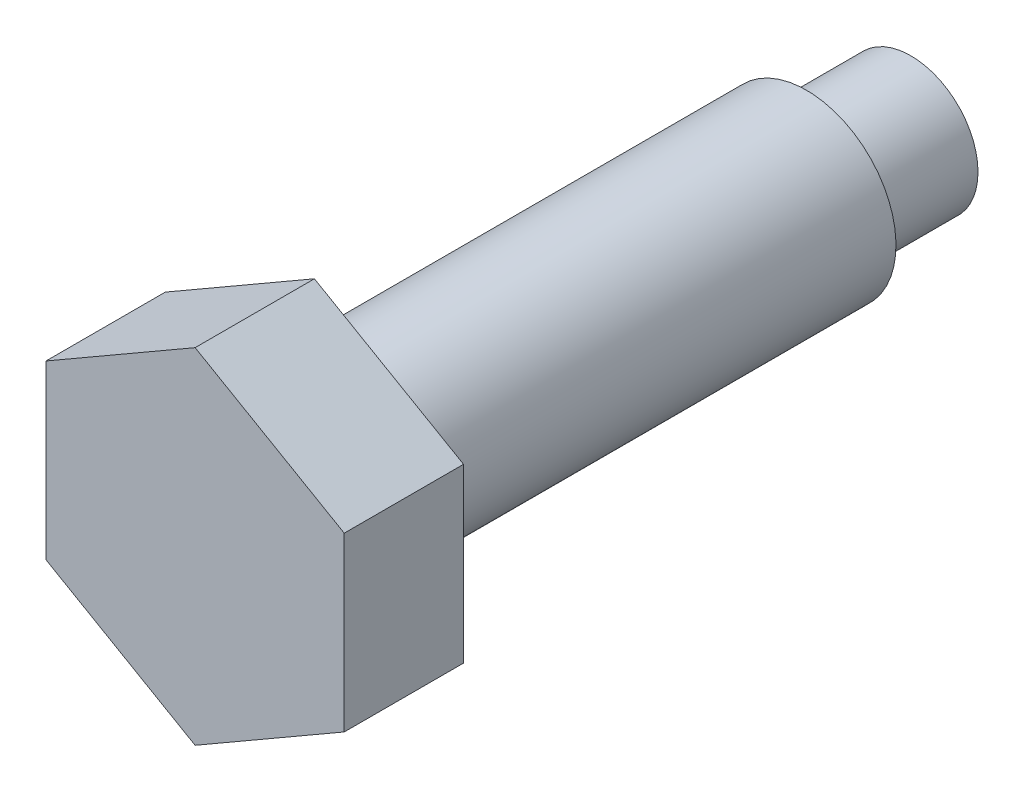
ISO-10303-21;
HEADER;
FILE_DESCRIPTION(('STEP AP214'),'2;1');
FILE_NAME('part.step','',(''),(''),'','','');
FILE_SCHEMA(('AUTOMOTIVE_DESIGN { 1 0 10303 214 1 1 1 1 }'));
ENDSEC;
DATA;
#1=APPLICATION_CONTEXT('core data for automotive mechanical design processes');
#2=APPLICATION_PROTOCOL_DEFINITION('international standard','automotive_design',2000,#1);
#3=PRODUCT_CONTEXT('',#1,'mechanical');
#4=PRODUCT('Part','Part','',(#3));
#5=PRODUCT_RELATED_PRODUCT_CATEGORY('part','',(#4));
#6=PRODUCT_DEFINITION_FORMATION('','',#4);
#7=PRODUCT_DEFINITION_CONTEXT('part definition',#1,'design');
#8=PRODUCT_DEFINITION('design','',#6,#7);
#9=PRODUCT_DEFINITION_SHAPE('','',#8);
#10=(LENGTH_UNIT() NAMED_UNIT(*) SI_UNIT(.MILLI.,.METRE.));
#11=(NAMED_UNIT(*) PLANE_ANGLE_UNIT() SI_UNIT($,.RADIAN.));
#12=(NAMED_UNIT(*) SI_UNIT($,.STERADIAN.) SOLID_ANGLE_UNIT());
#13=UNCERTAINTY_MEASURE_WITH_UNIT(LENGTH_MEASURE(1.E-05),#10,'distance_accuracy_value','');
#14=(GEOMETRIC_REPRESENTATION_CONTEXT(3) GLOBAL_UNCERTAINTY_ASSIGNED_CONTEXT((#13)) GLOBAL_UNIT_ASSIGNED_CONTEXT((#10,
#11,#12)) REPRESENTATION_CONTEXT('',''));
#15=CARTESIAN_POINT('',(0.,0.,0.));
#16=DIRECTION('',(0.,0.,1.));
#17=DIRECTION('',(1.,0.,0.));
#18=AXIS2_PLACEMENT_3D('',#15,#16,#17);
#19=CARTESIAN_POINT('',(-5.,8.66025403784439,0.));
#20=DIRECTION('',(0.,0.,1.));
#21=DIRECTION('',(0.,-1.,0.));
#22=AXIS2_PLACEMENT_3D('',#19,#20,#21);
#23=PLANE('',#22);
#24=DIRECTION('',(-0.866025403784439,0.5,0.));
#25=VECTOR('',#24,1.);
#26=CARTESIAN_POINT('',(5.,2.88675134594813,0.));
#27=LINE('',#26,#25);
#28=CARTESIAN_POINT('',(5.,2.88675134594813,0.));
#29=VERTEX_POINT('',#28);
#30=CARTESIAN_POINT('',(0.,5.77350269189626,0.));
#31=VERTEX_POINT('',#30);
#32=EDGE_CURVE('E72',#29,#31,#27,.T.);
#33=ORIENTED_EDGE('',*,*,#32,.F.);
#34=DIRECTION('',(0.,1.,0.));
#35=VECTOR('',#34,1.);
#36=CARTESIAN_POINT('',(5.,-2.88675134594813,0.));
#37=LINE('',#36,#35);
#38=CARTESIAN_POINT('',(5.,-2.88675134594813,0.));
#39=VERTEX_POINT('',#38);
#40=EDGE_CURVE('E99',#39,#29,#37,.T.);
#41=ORIENTED_EDGE('',*,*,#40,.F.);
#42=DIRECTION('',(0.866025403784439,0.5,0.));
#43=VECTOR('',#42,1.);
#44=CARTESIAN_POINT('',(0.,-5.77350269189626,0.));
#45=LINE('',#44,#43);
#46=CARTESIAN_POINT('',(0.,-5.77350269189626,0.));
#47=VERTEX_POINT('',#46);
#48=EDGE_CURVE('E97',#47,#39,#45,.T.);
#49=ORIENTED_EDGE('',*,*,#48,.F.);
#50=DIRECTION('',(0.866025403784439,-0.5,0.));
#51=VECTOR('',#50,1.);
#52=CARTESIAN_POINT('',(-5.,-2.88675134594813,0.));
#53=LINE('',#52,#51);
#54=CARTESIAN_POINT('',(-5.,-2.88675134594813,0.));
#55=VERTEX_POINT('',#54);
#56=EDGE_CURVE('E95',#55,#47,#53,.T.);
#57=ORIENTED_EDGE('',*,*,#56,.F.);
#58=DIRECTION('',(0.,-1.,0.));
#59=VECTOR('',#58,1.);
#60=CARTESIAN_POINT('',(-5.,2.88675134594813,0.));
#61=LINE('',#60,#59);
#62=CARTESIAN_POINT('',(-5.,2.88675134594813,0.));
#63=VERTEX_POINT('',#62);
#64=EDGE_CURVE('E74',#63,#55,#61,.T.);
#65=ORIENTED_EDGE('',*,*,#64,.F.);
#66=DIRECTION('',(-0.866025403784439,-0.5,0.));
#67=VECTOR('',#66,1.);
#68=CARTESIAN_POINT('',(0.,5.77350269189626,0.));
#69=LINE('',#68,#67);
#70=EDGE_CURVE('E67',#31,#63,#69,.T.);
#71=ORIENTED_EDGE('',*,*,#70,.F.);
#72=EDGE_LOOP('',(#33,#41,#49,#57,#65,#71));
#73=FACE_BOUND('',#72,.T.);
#74=CARTESIAN_POINT('',(0.,0.,0.));
#75=DIRECTION('',(0.,0.,1.));
#76=DIRECTION('',(0.,-1.,0.));
#77=AXIS2_PLACEMENT_3D('',#74,#75,#76);
#78=CIRCLE('',#77,3.);
#79=CARTESIAN_POINT('',(0.,-3.,0.));
#80=VERTEX_POINT('',#79);
#81=EDGE_CURVE('E9',#80,#80,#78,.F.);
#82=ORIENTED_EDGE('',*,*,#81,.F.);
#83=EDGE_LOOP('',(#82));
#84=FACE_BOUND('',#83,.T.);
#85=ADVANCED_FACE('F14',(#73,#84),#23,.F.);
#86=CARTESIAN_POINT('',(5.,2.88675134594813,4.));
#87=DIRECTION('',(-0.5,-0.866025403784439,0.));
#88=DIRECTION('',(0.866025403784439,-0.5,0.));
#89=AXIS2_PLACEMENT_3D('',#86,#87,#88);
#90=PLANE('',#89);
#91=ORIENTED_EDGE('',*,*,#32,.T.);
#92=DIRECTION('',(0.,0.,-1.));
#93=VECTOR('',#92,1.);
#94=CARTESIAN_POINT('',(0.,5.77350269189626,4.));
#95=LINE('',#94,#93);
#96=CARTESIAN_POINT('',(0.,5.77350269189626,4.));
#97=VERTEX_POINT('',#96);
#98=EDGE_CURVE('E22',#97,#31,#95,.T.);
#99=ORIENTED_EDGE('',*,*,#98,.F.);
#100=DIRECTION('',(-0.866025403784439,0.5,0.));
#101=VECTOR('',#100,1.);
#102=CARTESIAN_POINT('',(5.,2.88675134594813,4.));
#103=LINE('',#102,#101);
#104=CARTESIAN_POINT('',(5.,2.88675134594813,4.));
#105=VERTEX_POINT('',#104);
#106=EDGE_CURVE('E101',#105,#97,#103,.T.);
#107=ORIENTED_EDGE('',*,*,#106,.F.);
#108=DIRECTION('',(0.,0.,-1.));
#109=VECTOR('',#108,1.);
#110=CARTESIAN_POINT('',(5.,2.88675134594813,4.));
#111=LINE('',#110,#109);
#112=EDGE_CURVE('E86',#105,#29,#111,.T.);
#113=ORIENTED_EDGE('',*,*,#112,.T.);
#114=EDGE_LOOP('',(#91,#99,#107,#113));
#115=FACE_BOUND('',#114,.T.);
#116=ADVANCED_FACE('F16',(#115),#90,.F.);
#117=CARTESIAN_POINT('',(0.,5.77350269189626,4.));
#118=DIRECTION('',(0.5,-0.866025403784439,0.));
#119=DIRECTION('',(0.866025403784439,0.5,0.));
#120=AXIS2_PLACEMENT_3D('',#117,#118,#119);
#121=PLANE('',#120);
#122=ORIENTED_EDGE('',*,*,#70,.T.);
#123=DIRECTION('',(0.,0.,-1.));
#124=VECTOR('',#123,1.);
#125=CARTESIAN_POINT('',(-5.,2.88675134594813,4.));
#126=LINE('',#125,#124);
#127=CARTESIAN_POINT('',(-5.,2.88675134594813,4.));
#128=VERTEX_POINT('',#127);
#129=EDGE_CURVE('E84',#128,#63,#126,.T.);
#130=ORIENTED_EDGE('',*,*,#129,.F.);
#131=DIRECTION('',(-0.866025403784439,-0.5,0.));
#132=VECTOR('',#131,1.);
#133=CARTESIAN_POINT('',(0.,5.77350269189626,4.));
#134=LINE('',#133,#132);
#135=EDGE_CURVE('E81',#97,#128,#134,.T.);
#136=ORIENTED_EDGE('',*,*,#135,.F.);
#137=ORIENTED_EDGE('',*,*,#98,.T.);
#138=EDGE_LOOP('',(#122,#130,#136,#137));
#139=FACE_BOUND('',#138,.T.);
#140=ADVANCED_FACE('F80',(#139),#121,.F.);
#141=CARTESIAN_POINT('',(-5.,2.88675134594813,4.));
#142=DIRECTION('',(1.,0.,0.));
#143=DIRECTION('',(0.,1.,0.));
#144=AXIS2_PLACEMENT_3D('',#141,#142,#143);
#145=PLANE('',#144);
#146=ORIENTED_EDGE('',*,*,#64,.T.);
#147=DIRECTION('',(0.,0.,-1.));
#148=VECTOR('',#147,1.);
#149=CARTESIAN_POINT('',(-5.,-2.88675134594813,4.));
#150=LINE('',#149,#148);
#151=CARTESIAN_POINT('',(-5.,-2.88675134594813,4.));
#152=VERTEX_POINT('',#151);
#153=EDGE_CURVE('E117',#152,#55,#150,.T.);
#154=ORIENTED_EDGE('',*,*,#153,.F.);
#155=DIRECTION('',(0.,-1.,0.));
#156=VECTOR('',#155,1.);
#157=CARTESIAN_POINT('',(-5.,2.88675134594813,4.));
#158=LINE('',#157,#156);
#159=EDGE_CURVE('E104',#128,#152,#158,.T.);
#160=ORIENTED_EDGE('',*,*,#159,.F.);
#161=ORIENTED_EDGE('',*,*,#129,.T.);
#162=EDGE_LOOP('',(#146,#154,#160,#161));
#163=FACE_BOUND('',#162,.T.);
#164=ADVANCED_FACE('F122',(#163),#145,.F.);
#165=CARTESIAN_POINT('',(-5.,-2.88675134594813,4.));
#166=DIRECTION('',(0.5,0.866025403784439,0.));
#167=DIRECTION('',(-0.866025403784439,0.5,0.));
#168=AXIS2_PLACEMENT_3D('',#165,#166,#167);
#169=PLANE('',#168);
#170=ORIENTED_EDGE('',*,*,#56,.T.);
#171=DIRECTION('',(0.,0.,-1.));
#172=VECTOR('',#171,1.);
#173=CARTESIAN_POINT('',(0.,-5.77350269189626,4.));
#174=LINE('',#173,#172);
#175=CARTESIAN_POINT('',(0.,-5.77350269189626,4.));
#176=VERTEX_POINT('',#175);
#177=EDGE_CURVE('E114',#176,#47,#174,.T.);
#178=ORIENTED_EDGE('',*,*,#177,.F.);
#179=DIRECTION('',(0.866025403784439,-0.5,0.));
#180=VECTOR('',#179,1.);
#181=CARTESIAN_POINT('',(-5.,-2.88675134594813,4.));
#182=LINE('',#181,#180);
#183=EDGE_CURVE('E106',#152,#176,#182,.T.);
#184=ORIENTED_EDGE('',*,*,#183,.F.);
#185=ORIENTED_EDGE('',*,*,#153,.T.);
#186=EDGE_LOOP('',(#170,#178,#184,#185));
#187=FACE_BOUND('',#186,.T.);
#188=ADVANCED_FACE('F128',(#187),#169,.F.);
#189=CARTESIAN_POINT('',(0.,-5.77350269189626,4.));
#190=DIRECTION('',(-0.5,0.866025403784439,0.));
#191=DIRECTION('',(-0.866025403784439,-0.5,0.));
#192=AXIS2_PLACEMENT_3D('',#189,#190,#191);
#193=PLANE('',#192);
#194=ORIENTED_EDGE('',*,*,#48,.T.);
#195=DIRECTION('',(0.,0.,-1.));
#196=VECTOR('',#195,1.);
#197=CARTESIAN_POINT('',(5.,-2.88675134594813,4.));
#198=LINE('',#197,#196);
#199=CARTESIAN_POINT('',(5.,-2.88675134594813,4.));
#200=VERTEX_POINT('',#199);
#201=EDGE_CURVE('E111',#200,#39,#198,.T.);
#202=ORIENTED_EDGE('',*,*,#201,.F.);
#203=DIRECTION('',(0.866025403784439,0.5,0.));
#204=VECTOR('',#203,1.);
#205=CARTESIAN_POINT('',(0.,-5.77350269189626,4.));
#206=LINE('',#205,#204);
#207=EDGE_CURVE('E34',#176,#200,#206,.T.);
#208=ORIENTED_EDGE('',*,*,#207,.F.);
#209=ORIENTED_EDGE('',*,*,#177,.T.);
#210=EDGE_LOOP('',(#194,#202,#208,#209));
#211=FACE_BOUND('',#210,.T.);
#212=ADVANCED_FACE('F131',(#211),#193,.F.);
#213=CARTESIAN_POINT('',(5.,-2.88675134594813,4.));
#214=DIRECTION('',(-1.,0.,0.));
#215=DIRECTION('',(0.,-1.,0.));
#216=AXIS2_PLACEMENT_3D('',#213,#214,#215);
#217=PLANE('',#216);
#218=ORIENTED_EDGE('',*,*,#40,.T.);
#219=ORIENTED_EDGE('',*,*,#112,.F.);
#220=DIRECTION('',(0.,1.,0.));
#221=VECTOR('',#220,1.);
#222=CARTESIAN_POINT('',(5.,-2.88675134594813,4.));
#223=LINE('',#222,#221);
#224=EDGE_CURVE('E29',#200,#105,#223,.T.);
#225=ORIENTED_EDGE('',*,*,#224,.F.);
#226=ORIENTED_EDGE('',*,*,#201,.T.);
#227=EDGE_LOOP('',(#218,#219,#225,#226));
#228=FACE_BOUND('',#227,.T.);
#229=ADVANCED_FACE('F133',(#228),#217,.F.);
#230=CARTESIAN_POINT('',(-5.,8.66025403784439,4.));
#231=DIRECTION('',(0.,0.,1.));
#232=DIRECTION('',(0.,-1.,0.));
#233=AXIS2_PLACEMENT_3D('',#230,#231,#232);
#234=PLANE('',#233);
#235=ORIENTED_EDGE('',*,*,#106,.T.);
#236=ORIENTED_EDGE('',*,*,#135,.T.);
#237=ORIENTED_EDGE('',*,*,#159,.T.);
#238=ORIENTED_EDGE('',*,*,#183,.T.);
#239=ORIENTED_EDGE('',*,*,#207,.T.);
#240=ORIENTED_EDGE('',*,*,#224,.T.);
#241=EDGE_LOOP('',(#235,#236,#237,#238,#239,#240));
#242=FACE_BOUND('',#241,.T.);
#243=ADVANCED_FACE('F125',(#242),#234,.T.);
#244=CARTESIAN_POINT('',(0.,0.,0.));
#245=DIRECTION('',(0.,0.,1.));
#246=DIRECTION('',(0.,-1.,0.));
#247=AXIS2_PLACEMENT_3D('',#244,#245,#246);
#248=CYLINDRICAL_SURFACE('',#247,3.);
#249=ORIENTED_EDGE('',*,*,#81,.T.);
#250=EDGE_LOOP('',(#249));
#251=FACE_BOUND('',#250,.T.);
#252=CARTESIAN_POINT('',(0.,0.,-16.5));
#253=DIRECTION('',(0.,0.,1.));
#254=DIRECTION('',(0.,-1.,0.));
#255=AXIS2_PLACEMENT_3D('',#252,#253,#254);
#256=CIRCLE('',#255,3.);
#257=CARTESIAN_POINT('',(0.,-3.,-16.5));
#258=VERTEX_POINT('',#257);
#259=EDGE_CURVE('E87',#258,#258,#256,.T.);
#260=ORIENTED_EDGE('',*,*,#259,.T.);
#261=EDGE_LOOP('',(#260));
#262=FACE_BOUND('',#261,.T.);
#263=ADVANCED_FACE('F142',(#251,#262),#248,.T.);
#264=CARTESIAN_POINT('',(0.,0.,-16.9330127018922));
#265=DIRECTION('',(0.,0.,1.));
#266=DIRECTION('',(0.,-1.,0.));
#267=AXIS2_PLACEMENT_3D('',#264,#265,#266);
#268=CONICAL_SURFACE('',#267,2.25,1.0471975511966);
#269=ORIENTED_EDGE('',*,*,#259,.F.);
#270=EDGE_LOOP('',(#269));
#271=FACE_BOUND('',#270,.T.);
#272=CARTESIAN_POINT('',(0.,0.,-16.9330127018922));
#273=DIRECTION('',(0.,0.,1.));
#274=DIRECTION('',(0.,-1.,0.));
#275=AXIS2_PLACEMENT_3D('',#272,#273,#274);
#276=CIRCLE('',#275,2.25);
#277=CARTESIAN_POINT('',(0.,-2.25,-16.9330127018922));
#278=VERTEX_POINT('',#277);
#279=EDGE_CURVE('E90',#278,#278,#276,.T.);
#280=ORIENTED_EDGE('',*,*,#279,.T.);
#281=EDGE_LOOP('',(#280));
#282=FACE_BOUND('',#281,.T.);
#283=ADVANCED_FACE('F154',(#271,#282),#268,.T.);
#284=CARTESIAN_POINT('',(0.,0.,0.));
#285=DIRECTION('',(0.,0.,1.));
#286=DIRECTION('',(0.,-1.,0.));
#287=AXIS2_PLACEMENT_3D('',#284,#285,#286);
#288=CYLINDRICAL_SURFACE('',#287,2.25);
#289=ORIENTED_EDGE('',*,*,#279,.F.);
#290=EDGE_LOOP('',(#289));
#291=FACE_BOUND('',#290,.T.);
#292=CARTESIAN_POINT('',(0.,0.,-20.));
#293=DIRECTION('',(0.,0.,1.));
#294=DIRECTION('',(0.,-1.,0.));
#295=AXIS2_PLACEMENT_3D('',#292,#293,#294);
#296=CIRCLE('',#295,2.25);
#297=CARTESIAN_POINT('',(0.,-2.25,-20.));
#298=VERTEX_POINT('',#297);
#299=EDGE_CURVE('E171',#298,#298,#296,.T.);
#300=ORIENTED_EDGE('',*,*,#299,.T.);
#301=EDGE_LOOP('',(#300));
#302=FACE_BOUND('',#301,.T.);
#303=ADVANCED_FACE('F158',(#291,#302),#288,.T.);
#304=CARTESIAN_POINT('',(0.,0.,-16.6928108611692));
#305=DIRECTION('',(0.,0.,1.));
#306=DIRECTION('',(1.,0.,0.));
#307=AXIS2_PLACEMENT_3D('',#304,#305,#306);
#308=SPHERICAL_SURFACE('',#307,4.);
#309=ORIENTED_EDGE('',*,*,#299,.F.);
#310=EDGE_LOOP('',(#309));
#311=FACE_BOUND('',#310,.T.);
#312=ADVANCED_FACE('F162',(#311),#308,.T.);
#313=CLOSED_SHELL('',(#85,#116,#140,#164,#188,#212,#229,#243,#263,#283,#303,#312));
#314=MANIFOLD_SOLID_BREP('B1',#313);
#315=ADVANCED_BREP_SHAPE_REPRESENTATION('',(#18,#314),#14);
#316=SHAPE_DEFINITION_REPRESENTATION(#9,#315);
ENDSEC;
END-ISO-10303-21;
